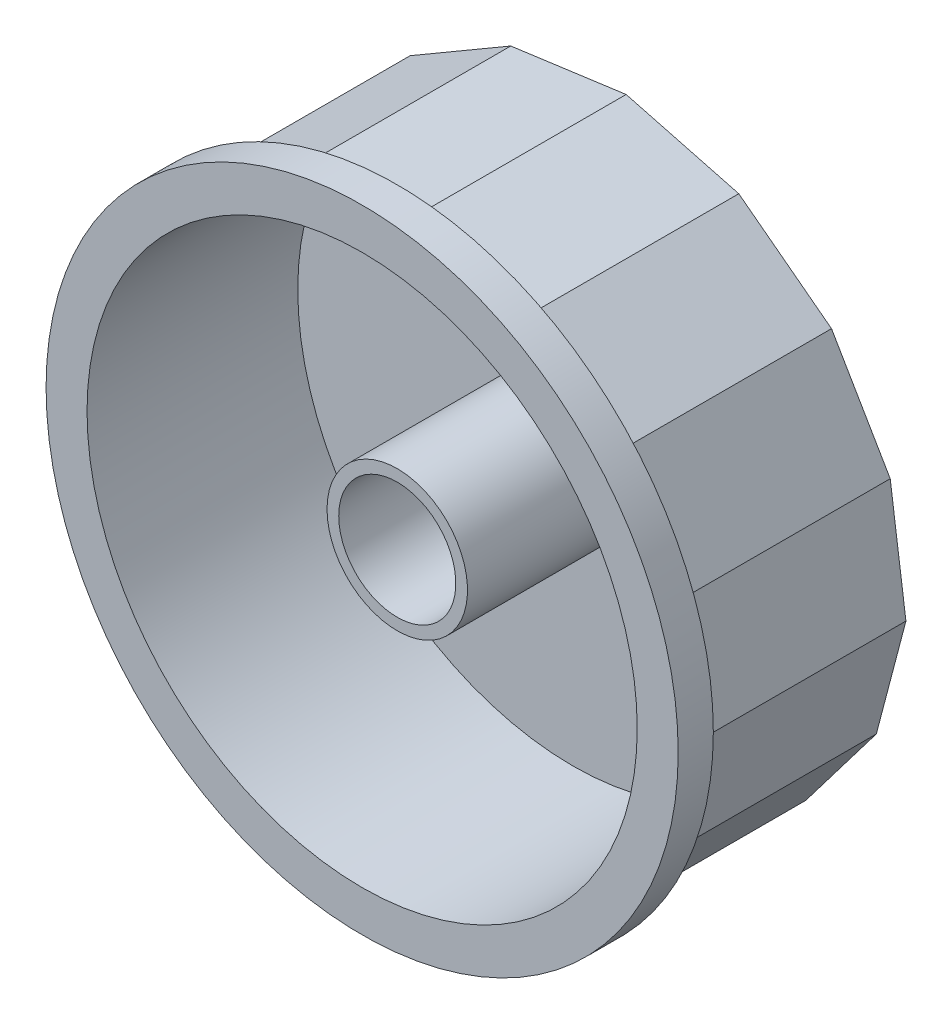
from build123d import *

# Parameters (mm, degrees)
CROQUIS1_R                   = 25.5
SALIENTE_EXTRUIR1_DEPTH      = 18
CROQUIS2_R                   = 27
SALIENTE_EXTRUIR2_DEPTH      = 3
CORTAR_EXTRUIR1_DEPTH        = 18
CROQUIS6_R                   = 23.5
CORTAR_EXTRUIR3_DEPTH        = 18
CROQUIS7_R                   = 5
CORTAR_EXTRUIR4_DEPTH        = 44.577517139
SALIENTE_EXTRUIR3_DEPTH      = 12
SALIENTE_EXTRUIR3_DEPTH_BACK = 18
CROQUIS8_R                   = 6
CORTAR_EXTRUIR5_DEPTH        = 51.467811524
CORTAR_EXTRUIR5_DEPTH_BACK   = 51.467811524
CROQUIS9_R                   = 5
CROQUIS10_R                  = 11
CROQUIS10_R_2                = 6
CORTAR_EXTRUIR6_DEPTH        = 1


with BuildPart() as part:
    # Croquis1 → Saliente-Extruir1 (new body)
    with BuildSketch(Plane.XY):
        Circle(CROQUIS1_R)
    extrude(amount=SALIENTE_EXTRUIR1_DEPTH)

    # Croquis2 → Saliente-Extruir2 (add)
    with BuildSketch(Plane.XY.offset(18)):
        Circle(CROQUIS2_R)
    extrude(amount=SALIENTE_EXTRUIR2_DEPTH)

    # Croquis4 → Cortar-Extruir1 (cut)
    with BuildSketch(Plane(origin=(0, 0, 0), x_dir=(-1, 0, 0), z_dir=(0, 0, -1))):
        with BuildLine():
            Line((-24.109327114, 8.306042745), (-19.095528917, 16.900022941))
            ThreePointArc((-19.095528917, 16.900022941), (-22.0256446, 12.849940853), (-24.109327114, 8.306042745))
        make_face()
        with BuildLine():
            Line((-19.095528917, 16.900022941), (-11.174609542, 22.921127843))
            ThreePointArc((-11.174609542, 22.921127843), (-15.431582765, 20.300646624), (-19.095528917, 16.900022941))
        make_face()
        with BuildLine():
            Line((-11.174609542, 22.921127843), (-1.552457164, 25.452698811))
            ThreePointArc((-1.552457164, 25.452698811), (-6.488202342, 24.660762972), (-11.174609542, 22.921127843))
        make_face()
        with BuildLine():
            Line((-1.552457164, 25.452698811), (8.306042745, 24.109327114))
            ThreePointArc((8.306042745, 24.109327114), (3.442948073, 25.266501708), (-1.552457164, 25.452698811))
        make_face()
        with BuildLine():
            Line((8.306042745, 24.109327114), (16.900022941, 19.095528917))
            ThreePointArc((16.900022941, 19.095528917), (12.849940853, 22.0256446), (8.306042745, 24.109327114))
        make_face()
        with BuildLine():
            Line((16.900022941, 19.095528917), (22.921127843, 11.174609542))
            ThreePointArc((22.921127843, 11.174609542), (20.300646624, 15.431582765), (16.900022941, 19.095528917))
        make_face()
        with BuildLine():
            Line((22.921127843, 11.174609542), (25.452698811, 1.552457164))
            ThreePointArc((25.452698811, 1.552457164), (24.660762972, 6.488202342), (22.921127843, 11.174609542))
        make_face()
        with BuildLine():
            Line((25.452698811, 1.552457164), (24.109327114, -8.306042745))
            ThreePointArc((24.109327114, -8.306042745), (25.149928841, -4.210828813), (25.5, 0))
            ThreePointArc((25.5, 0), (25.48817196, 0.776588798), (25.452698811, 1.552457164))
        make_face()
        with BuildLine():
            ThreePointArc((19.095528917, -16.900022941), (22.0256446, -12.849940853), (24.109327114, -8.306042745))
            Line((24.109327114, -8.306042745), (19.095528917, -16.900022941))
        make_face()
        with BuildLine():
            ThreePointArc((11.174609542, -22.921127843), (15.431582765, -20.300646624), (19.095528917, -16.900022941))
            Line((19.095528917, -16.900022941), (11.174609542, -22.921127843))
        make_face()
        with BuildLine():
            ThreePointArc((1.552457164, -25.452698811), (6.488202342, -24.660762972), (11.174609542, -22.921127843))
            Line((11.174609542, -22.921127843), (1.552457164, -25.452698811))
        make_face()
        with BuildLine():
            ThreePointArc((-8.306042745, -24.109327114), (-3.442948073, -25.266501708), (1.552457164, -25.452698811))
            Line((1.552457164, -25.452698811), (-8.306042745, -24.109327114))
        make_face()
        with BuildLine():
            ThreePointArc((-16.900022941, -19.095528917), (-12.849940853, -22.0256446), (-8.306042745, -24.109327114))
            Line((-8.306042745, -24.109327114), (-16.900022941, -19.095528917))
        make_face()
        with BuildLine():
            ThreePointArc((-22.921127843, -11.174609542), (-20.300646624, -15.431582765), (-16.900022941, -19.095528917))
            Line((-16.900022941, -19.095528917), (-22.921127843, -11.174609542))
        make_face()
        with BuildLine():
            ThreePointArc((-25.452698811, -1.552457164), (-24.660762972, -6.488202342), (-22.921127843, -11.174609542))
            Line((-22.921127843, -11.174609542), (-25.452698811, -1.552457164))
        make_face()
        with BuildLine():
            ThreePointArc((-24.109327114, 8.306042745), (-25.266501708, 3.442948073), (-25.452698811, -1.552457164))
            Line((-25.452698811, -1.552457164), (-24.109327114, 8.306042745))
        make_face()
    extrude(amount=-CORTAR_EXTRUIR1_DEPTH, mode=Mode.SUBTRACT)

    # Croquis6 → Cortar-Extruir3 (cut)
    with BuildSketch(Plane.XY.offset(21)):
        Circle(CROQUIS6_R)
    extrude(amount=-CORTAR_EXTRUIR3_DEPTH, mode=Mode.SUBTRACT)

    # Croquis7 → Cortar-Extruir4 (cut, through all)
    with BuildSketch(Plane(origin=(0, 0, 0), x_dir=(-1, 0, 0), z_dir=(0, 0, -1))):
        Circle(CROQUIS7_R)
    extrude(amount=-CORTAR_EXTRUIR4_DEPTH, mode=Mode.SUBTRACT)

    # Croquis8 → Saliente-Extruir3 (add, two sides: drawn at the far end of the back side and taken through both)
    with BuildSketch(Plane(origin=(0, 0, 0), x_dir=(-1, 0, 0), z_dir=(0, 0, -1)).offset(-SALIENTE_EXTRUIR3_DEPTH_BACK)):
        Circle(CROQUIS8_R)
    extrude(amount=SALIENTE_EXTRUIR3_DEPTH + SALIENTE_EXTRUIR3_DEPTH_BACK)

    # Croquis9 → Cortar-Extruir5 (cut, two sides: drawn at the far end of the back side and taken through both)
    with BuildSketch(Plane(origin=(0, 0, -12), x_dir=(-1, 0, 0), z_dir=(0, 0, -1)).offset(-CORTAR_EXTRUIR5_DEPTH_BACK)):
        Circle(CROQUIS9_R)
    extrude(amount=CORTAR_EXTRUIR5_DEPTH + CORTAR_EXTRUIR5_DEPTH_BACK, mode=Mode.SUBTRACT)

    # Croquis10 → Cortar-Extruir6 (cut)
    with BuildSketch(Plane(origin=(0, 0, 0), x_dir=(-1, 0, 0), z_dir=(0, 0, -1))):
        Circle(CROQUIS10_R)
        Circle(CROQUIS10_R_2, mode=Mode.SUBTRACT)
    extrude(amount=-CORTAR_EXTRUIR6_DEPTH, mode=Mode.SUBTRACT)


solid = part.part
